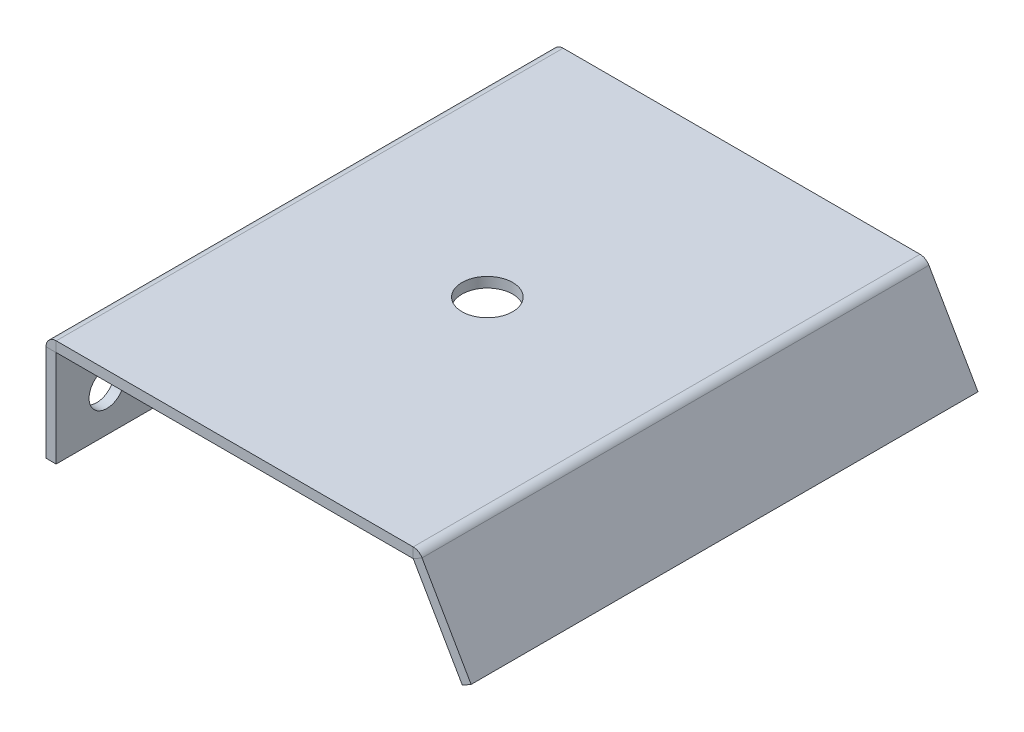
ISO-10303-21;
HEADER;
FILE_DESCRIPTION(('STEP AP214'),'2;1');
FILE_NAME('part.step','',(''),(''),'','','');
FILE_SCHEMA(('AUTOMOTIVE_DESIGN { 1 0 10303 214 1 1 1 1 }'));
ENDSEC;
DATA;
#1=APPLICATION_CONTEXT('core data for automotive mechanical design processes');
#2=APPLICATION_PROTOCOL_DEFINITION('international standard','automotive_design',2000,#1);
#3=PRODUCT_CONTEXT('',#1,'mechanical');
#4=PRODUCT('Part','Part','',(#3));
#5=PRODUCT_RELATED_PRODUCT_CATEGORY('part','',(#4));
#6=PRODUCT_DEFINITION_FORMATION('','',#4);
#7=PRODUCT_DEFINITION_CONTEXT('part definition',#1,'design');
#8=PRODUCT_DEFINITION('design','',#6,#7);
#9=PRODUCT_DEFINITION_SHAPE('','',#8);
#10=(LENGTH_UNIT() NAMED_UNIT(*) SI_UNIT(.MILLI.,.METRE.));
#11=(NAMED_UNIT(*) PLANE_ANGLE_UNIT() SI_UNIT($,.RADIAN.));
#12=(NAMED_UNIT(*) SI_UNIT($,.STERADIAN.) SOLID_ANGLE_UNIT());
#13=UNCERTAINTY_MEASURE_WITH_UNIT(LENGTH_MEASURE(1.E-05),#10,'distance_accuracy_value','');
#14=(GEOMETRIC_REPRESENTATION_CONTEXT(3) GLOBAL_UNCERTAINTY_ASSIGNED_CONTEXT((#13)) GLOBAL_UNIT_ASSIGNED_CONTEXT((#10,
#11,#12)) REPRESENTATION_CONTEXT('',''));
#15=CARTESIAN_POINT('',(0.,0.,0.));
#16=DIRECTION('',(0.,0.,1.));
#17=DIRECTION('',(1.,0.,0.));
#18=AXIS2_PLACEMENT_3D('',#15,#16,#17);
#19=CARTESIAN_POINT('',(0.,1.,0.));
#20=DIRECTION('',(0.,0.,-1.));
#21=DIRECTION('',(-1.,0.,0.));
#22=AXIS2_PLACEMENT_3D('',#19,#20,#21);
#23=PLANE('',#22);
#24=DIRECTION('',(1.,0.,0.));
#25=VECTOR('',#24,1.);
#26=CARTESIAN_POINT('',(0.,1.,0.));
#27=LINE('',#26,#25);
#28=CARTESIAN_POINT('',(10.4735950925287,0.999999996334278,0.));
#29=VERTEX_POINT('',#28);
#30=CARTESIAN_POINT('',(45.6842699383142,1.,0.));
#31=VERTEX_POINT('',#30);
#32=EDGE_CURVE('E271',#29,#31,#27,.T.);
#33=ORIENTED_EDGE('',*,*,#32,.F.);
#34=DIRECTION('',(0.,-1.,0.));
#35=VECTOR('',#34,1.);
#36=CARTESIAN_POINT('',(10.4735950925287,1.,0.));
#37=LINE('',#36,#35);
#38=CARTESIAN_POINT('',(10.4735950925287,0.,0.));
#39=VERTEX_POINT('',#38);
#40=EDGE_CURVE('E12',#29,#39,#37,.T.);
#41=ORIENTED_EDGE('',*,*,#40,.T.);
#42=DIRECTION('',(1.,0.,0.));
#43=VECTOR('',#42,1.);
#44=CARTESIAN_POINT('',(0.,0.,0.));
#45=LINE('',#44,#43);
#46=CARTESIAN_POINT('',(45.6842699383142,0.,0.));
#47=VERTEX_POINT('',#46);
#48=EDGE_CURVE('E216',#39,#47,#45,.T.);
#49=ORIENTED_EDGE('',*,*,#48,.T.);
#50=DIRECTION('',(0.,-1.,0.));
#51=VECTOR('',#50,1.);
#52=CARTESIAN_POINT('',(45.6842699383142,1.,0.));
#53=LINE('',#52,#51);
#54=EDGE_CURVE('E227',#31,#47,#53,.T.);
#55=ORIENTED_EDGE('',*,*,#54,.F.);
#56=EDGE_LOOP('',(#33,#41,#49,#55));
#57=FACE_BOUND('',#56,.T.);
#58=ADVANCED_FACE('F42',(#57),#23,.F.);
#59=CARTESIAN_POINT('',(0.,1.,-50.));
#60=DIRECTION('',(0.,0.,1.));
#61=DIRECTION('',(1.,0.,0.));
#62=AXIS2_PLACEMENT_3D('',#59,#60,#61);
#63=PLANE('',#62);
#64=DIRECTION('',(-1.,0.,0.));
#65=VECTOR('',#64,1.);
#66=CARTESIAN_POINT('',(0.,0.,-50.));
#67=LINE('',#66,#65);
#68=CARTESIAN_POINT('',(45.6842699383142,0.,-50.));
#69=VERTEX_POINT('',#68);
#70=CARTESIAN_POINT('',(10.4735950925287,-7.33144361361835E-09,-50.));
#71=VERTEX_POINT('',#70);
#72=EDGE_CURVE('E220',#69,#71,#67,.T.);
#73=ORIENTED_EDGE('',*,*,#72,.T.);
#74=DIRECTION('',(0.,1.,0.));
#75=VECTOR('',#74,1.);
#76=CARTESIAN_POINT('',(10.4735950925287,1.,-50.));
#77=LINE('',#76,#75);
#78=CARTESIAN_POINT('',(10.4735950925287,0.999999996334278,-50.));
#79=VERTEX_POINT('',#78);
#80=EDGE_CURVE('E265',#71,#79,#77,.T.);
#81=ORIENTED_EDGE('',*,*,#80,.T.);
#82=DIRECTION('',(-1.,0.,0.));
#83=VECTOR('',#82,1.);
#84=CARTESIAN_POINT('',(0.,1.,-50.));
#85=LINE('',#84,#83);
#86=CARTESIAN_POINT('',(45.6842699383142,1.000000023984,-50.));
#87=VERTEX_POINT('',#86);
#88=EDGE_CURVE('E45',#87,#79,#85,.T.);
#89=ORIENTED_EDGE('',*,*,#88,.F.);
#90=DIRECTION('',(0.,1.,0.));
#91=VECTOR('',#90,1.);
#92=CARTESIAN_POINT('',(45.6842699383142,1.,-50.));
#93=LINE('',#92,#91);
#94=EDGE_CURVE('E224',#69,#87,#93,.T.);
#95=ORIENTED_EDGE('',*,*,#94,.F.);
#96=EDGE_LOOP('',(#73,#81,#89,#95));
#97=FACE_BOUND('',#96,.T.);
#98=ADVANCED_FACE('F281',(#97),#63,.F.);
#99=CARTESIAN_POINT('',(0.,1.,-50.));
#100=DIRECTION('',(0.,-1.,0.));
#101=DIRECTION('',(0.,0.,-1.));
#102=AXIS2_PLACEMENT_3D('',#99,#100,#101);
#103=PLANE('',#102);
#104=CARTESIAN_POINT('',(28.,1.,-25.));
#105=DIRECTION('',(0.,1.,0.));
#106=DIRECTION('',(0.,0.,1.));
#107=AXIS2_PLACEMENT_3D('',#104,#105,#106);
#108=CIRCLE('',#107,2.5);
#109=CARTESIAN_POINT('',(28.,1.,-22.5));
#110=VERTEX_POINT('',#109);
#111=EDGE_CURVE('E221',#110,#110,#108,.T.);
#112=ORIENTED_EDGE('',*,*,#111,.F.);
#113=EDGE_LOOP('',(#112));
#114=FACE_BOUND('',#113,.T.);
#115=ORIENTED_EDGE('',*,*,#88,.T.);
#116=DIRECTION('',(0.,0.,1.));
#117=VECTOR('',#116,1.);
#118=CARTESIAN_POINT('',(10.4735950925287,1.,-50.));
#119=LINE('',#118,#117);
#120=EDGE_CURVE('E256',#79,#29,#119,.T.);
#121=ORIENTED_EDGE('',*,*,#120,.T.);
#122=ORIENTED_EDGE('',*,*,#32,.T.);
#123=DIRECTION('',(0.,0.,1.));
#124=VECTOR('',#123,1.);
#125=CARTESIAN_POINT('',(45.6842699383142,1.,-50.));
#126=LINE('',#125,#124);
#127=EDGE_CURVE('E212',#87,#31,#126,.T.);
#128=ORIENTED_EDGE('',*,*,#127,.F.);
#129=EDGE_LOOP('',(#115,#121,#122,#128));
#130=FACE_BOUND('',#129,.T.);
#131=ADVANCED_FACE('F277',(#114,#130),#103,.F.);
#132=CARTESIAN_POINT('',(23.4010905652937,40.6055988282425,-50.));
#133=DIRECTION('',(0.,0.,1.));
#134=DIRECTION('',(0.499999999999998,-0.86602540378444,0.));
#135=AXIS2_PLACEMENT_3D('',#132,#133,#134);
#136=PLANE('',#135);
#137=DIRECTION('',(-0.499999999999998,0.86602540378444,0.));
#138=VECTOR('',#137,1.);
#139=CARTESIAN_POINT('',(22.5350651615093,40.1055988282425,-50.));
#140=LINE('',#139,#138);
#141=CARTESIAN_POINT('',(50.5350651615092,-8.39182378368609,-50.));
#142=VERTEX_POINT('',#141);
#143=CARTESIAN_POINT('',(45.6929302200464,-0.0049999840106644,-50.));
#144=VERTEX_POINT('',#143);
#145=EDGE_CURVE('E234',#142,#144,#140,.T.);
#146=ORIENTED_EDGE('',*,*,#145,.T.);
#147=DIRECTION('',(0.86602540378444,0.499999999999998,0.));
#148=VECTOR('',#147,1.);
#149=CARTESIAN_POINT('',(46.5589555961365,0.494999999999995,-50.));
#150=LINE('',#149,#148);
#151=CARTESIAN_POINT('',(46.5589556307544,0.495000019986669,-50.));
#152=VERTEX_POINT('',#151);
#153=EDGE_CURVE('E249',#144,#152,#150,.T.);
#154=ORIENTED_EDGE('',*,*,#153,.T.);
#155=DIRECTION('',(-0.499999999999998,0.86602540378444,0.));
#156=VECTOR('',#155,1.);
#157=CARTESIAN_POINT('',(23.4010905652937,40.6055988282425,-50.));
#158=LINE('',#157,#156);
#159=CARTESIAN_POINT('',(51.4010905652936,-7.89182378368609,-50.));
#160=VERTEX_POINT('',#159);
#161=EDGE_CURVE('E238',#160,#152,#158,.T.);
#162=ORIENTED_EDGE('',*,*,#161,.F.);
#163=DIRECTION('',(-0.86602540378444,-0.499999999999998,0.));
#164=VECTOR('',#163,1.);
#165=CARTESIAN_POINT('',(51.4010905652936,-7.89182378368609,-50.));
#166=LINE('',#165,#164);
#167=EDGE_CURVE('E240',#160,#142,#166,.T.);
#168=ORIENTED_EDGE('',*,*,#167,.T.);
#169=EDGE_LOOP('',(#146,#154,#162,#168));
#170=FACE_BOUND('',#169,.T.);
#171=ADVANCED_FACE('F329',(#170),#136,.F.);
#172=CARTESIAN_POINT('',(23.4010905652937,40.6055988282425,0.));
#173=DIRECTION('',(0.,0.,-1.));
#174=DIRECTION('',(-0.499999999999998,0.86602540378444,0.));
#175=AXIS2_PLACEMENT_3D('',#172,#173,#174);
#176=PLANE('',#175);
#177=DIRECTION('',(0.499999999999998,-0.86602540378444,0.));
#178=VECTOR('',#177,1.);
#179=CARTESIAN_POINT('',(23.4010905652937,40.6055988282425,0.));
#180=LINE('',#179,#178);
#181=CARTESIAN_POINT('',(46.5589556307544,0.495000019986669,0.));
#182=VERTEX_POINT('',#181);
#183=CARTESIAN_POINT('',(51.4010905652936,-7.89182378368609,0.));
#184=VERTEX_POINT('',#183);
#185=EDGE_CURVE('E239',#182,#184,#180,.T.);
#186=ORIENTED_EDGE('',*,*,#185,.F.);
#187=DIRECTION('',(-0.86602540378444,-0.499999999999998,0.));
#188=VECTOR('',#187,1.);
#189=CARTESIAN_POINT('',(46.5589555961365,0.494999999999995,0.));
#190=LINE('',#189,#188);
#191=CARTESIAN_POINT('',(45.6929301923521,-0.005000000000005,0.));
#192=VERTEX_POINT('',#191);
#193=EDGE_CURVE('E253',#182,#192,#190,.T.);
#194=ORIENTED_EDGE('',*,*,#193,.T.);
#195=DIRECTION('',(0.499999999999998,-0.86602540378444,0.));
#196=VECTOR('',#195,1.);
#197=CARTESIAN_POINT('',(22.5350651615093,40.1055988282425,0.));
#198=LINE('',#197,#196);
#199=CARTESIAN_POINT('',(50.5350651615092,-8.39182378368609,0.));
#200=VERTEX_POINT('',#199);
#201=EDGE_CURVE('E235',#192,#200,#198,.T.);
#202=ORIENTED_EDGE('',*,*,#201,.T.);
#203=DIRECTION('',(-0.86602540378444,-0.499999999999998,0.));
#204=VECTOR('',#203,1.);
#205=CARTESIAN_POINT('',(51.4010905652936,-7.89182378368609,0.));
#206=LINE('',#205,#204);
#207=EDGE_CURVE('E243',#184,#200,#206,.T.);
#208=ORIENTED_EDGE('',*,*,#207,.F.);
#209=EDGE_LOOP('',(#186,#194,#202,#208));
#210=FACE_BOUND('',#209,.T.);
#211=ADVANCED_FACE('F321',(#210),#176,.F.);
#212=CARTESIAN_POINT('',(23.4010905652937,40.6055988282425,-50.));
#213=DIRECTION('',(-0.86602540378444,-0.499999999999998,0.));
#214=DIRECTION('',(0.,0.,-1.));
#215=AXIS2_PLACEMENT_3D('',#212,#213,#214);
#216=PLANE('',#215);
#217=ORIENTED_EDGE('',*,*,#161,.T.);
#218=DIRECTION('',(0.,0.,1.));
#219=VECTOR('',#218,1.);
#220=CARTESIAN_POINT('',(46.5589555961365,0.494999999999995,-50.));
#221=LINE('',#220,#219);
#222=EDGE_CURVE('E246',#152,#182,#221,.T.);
#223=ORIENTED_EDGE('',*,*,#222,.T.);
#224=ORIENTED_EDGE('',*,*,#185,.T.);
#225=DIRECTION('',(0.,0.,-1.));
#226=VECTOR('',#225,1.);
#227=CARTESIAN_POINT('',(51.4010905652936,-7.89182378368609,0.));
#228=LINE('',#227,#226);
#229=EDGE_CURVE('E236',#184,#160,#228,.T.);
#230=ORIENTED_EDGE('',*,*,#229,.T.);
#231=EDGE_LOOP('',(#217,#223,#224,#230));
#232=FACE_BOUND('',#231,.T.);
#233=ADVANCED_FACE('F325',(#232),#216,.F.);
#234=CARTESIAN_POINT('',(22.5350651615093,40.1055988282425,-50.));
#235=DIRECTION('',(-0.86602540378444,-0.499999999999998,0.));
#236=DIRECTION('',(0.,0.,-1.));
#237=AXIS2_PLACEMENT_3D('',#234,#235,#236);
#238=PLANE('',#237);
#239=DIRECTION('',(0.,0.,1.));
#240=VECTOR('',#239,1.);
#241=CARTESIAN_POINT('',(45.6929301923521,-0.005000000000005,-50.));
#242=LINE('',#241,#240);
#243=EDGE_CURVE('E65',#144,#192,#242,.T.);
#244=ORIENTED_EDGE('',*,*,#243,.F.);
#245=ORIENTED_EDGE('',*,*,#145,.F.);
#246=DIRECTION('',(0.,0.,-1.));
#247=VECTOR('',#246,1.);
#248=CARTESIAN_POINT('',(50.5350651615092,-8.39182378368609,0.));
#249=LINE('',#248,#247);
#250=EDGE_CURVE('E232',#200,#142,#249,.T.);
#251=ORIENTED_EDGE('',*,*,#250,.F.);
#252=ORIENTED_EDGE('',*,*,#201,.F.);
#253=EDGE_LOOP('',(#244,#245,#251,#252));
#254=FACE_BOUND('',#253,.T.);
#255=ADVANCED_FACE('F349',(#254),#238,.T.);
#256=CARTESIAN_POINT('',(51.4010905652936,-7.89182378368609,0.));
#257=DIRECTION('',(-0.499999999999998,0.86602540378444,0.));
#258=DIRECTION('',(0.,0.,1.));
#259=AXIS2_PLACEMENT_3D('',#256,#257,#258);
#260=PLANE('',#259);
#261=ORIENTED_EDGE('',*,*,#250,.T.);
#262=ORIENTED_EDGE('',*,*,#167,.F.);
#263=ORIENTED_EDGE('',*,*,#229,.F.);
#264=ORIENTED_EDGE('',*,*,#207,.T.);
#265=EDGE_LOOP('',(#261,#262,#263,#264));
#266=FACE_BOUND('',#265,.T.);
#267=ADVANCED_FACE('F343',(#266),#260,.F.);
#268=CARTESIAN_POINT('',(28.,1.,-25.));
#269=DIRECTION('',(0.,-1.,0.));
#270=DIRECTION('',(0.,0.,-1.));
#271=AXIS2_PLACEMENT_3D('',#268,#269,#270);
#272=CYLINDRICAL_SURFACE('',#271,2.5);
#273=ORIENTED_EDGE('',*,*,#111,.T.);
#274=EDGE_LOOP('',(#273));
#275=FACE_BOUND('',#274,.T.);
#276=CARTESIAN_POINT('',(28.,0.,-25.));
#277=DIRECTION('',(0.,1.,0.));
#278=DIRECTION('',(0.,0.,1.));
#279=AXIS2_PLACEMENT_3D('',#276,#277,#278);
#280=CIRCLE('',#279,2.5);
#281=CARTESIAN_POINT('',(28.,0.,-22.5));
#282=VERTEX_POINT('',#281);
#283=EDGE_CURVE('E217',#282,#282,#280,.T.);
#284=ORIENTED_EDGE('',*,*,#283,.F.);
#285=EDGE_LOOP('',(#284));
#286=FACE_BOUND('',#285,.T.);
#287=ADVANCED_FACE('F339',(#275,#286),#272,.F.);
#288=CARTESIAN_POINT('',(0.,0.,-50.));
#289=DIRECTION('',(0.,-1.,0.));
#290=DIRECTION('',(0.,0.,-1.));
#291=AXIS2_PLACEMENT_3D('',#288,#289,#290);
#292=PLANE('',#291);
#293=DIRECTION('',(0.,0.,1.));
#294=VECTOR('',#293,1.);
#295=CARTESIAN_POINT('',(10.4735950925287,0.,-50.));
#296=LINE('',#295,#294);
#297=EDGE_CURVE('E50',#71,#39,#296,.T.);
#298=ORIENTED_EDGE('',*,*,#297,.F.);
#299=ORIENTED_EDGE('',*,*,#72,.F.);
#300=DIRECTION('',(0.,0.,1.));
#301=VECTOR('',#300,1.);
#302=CARTESIAN_POINT('',(45.6842699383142,0.,-50.));
#303=LINE('',#302,#301);
#304=EDGE_CURVE('E213',#69,#47,#303,.T.);
#305=ORIENTED_EDGE('',*,*,#304,.T.);
#306=ORIENTED_EDGE('',*,*,#48,.F.);
#307=EDGE_LOOP('',(#298,#299,#305,#306));
#308=FACE_BOUND('',#307,.T.);
#309=ORIENTED_EDGE('',*,*,#283,.T.);
#310=EDGE_LOOP('',(#309));
#311=FACE_BOUND('',#310,.T.);
#312=ADVANCED_FACE('F336',(#308,#311),#292,.T.);
#313=CARTESIAN_POINT('',(45.6842699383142,-0.0100000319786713,-50.));
#314=DIRECTION('',(0.,0.,-1.));
#315=DIRECTION('',(-1.,0.,0.));
#316=AXIS2_PLACEMENT_3D('',#313,#314,#315);
#317=PLANE('',#316);
#318=ORIENTED_EDGE('',*,*,#153,.F.);
#319=CARTESIAN_POINT('',(45.6842699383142,-0.01,-50.));
#320=DIRECTION('',(0.,0.,-1.));
#321=DIRECTION('',(-1.,0.,0.));
#322=AXIS2_PLACEMENT_3D('',#319,#320,#321);
#323=CIRCLE('',#322,0.0100000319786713);
#324=EDGE_CURVE('E201',#144,#69,#323,.F.);
#325=ORIENTED_EDGE('',*,*,#324,.T.);
#326=ORIENTED_EDGE('',*,*,#94,.T.);
#327=CARTESIAN_POINT('',(45.6842699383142,-0.0100000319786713,-50.));
#328=DIRECTION('',(0.,0.,1.));
#329=DIRECTION('',(1.,0.,0.));
#330=AXIS2_PLACEMENT_3D('',#327,#328,#329);
#331=CIRCLE('',#330,1.01000005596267);
#332=EDGE_CURVE('E204',#152,#87,#331,.T.);
#333=ORIENTED_EDGE('',*,*,#332,.F.);
#334=EDGE_LOOP('',(#318,#325,#326,#333));
#335=FACE_BOUND('',#334,.T.);
#336=ADVANCED_FACE('F332',(#335),#317,.T.);
#337=CARTESIAN_POINT('',(45.6842699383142,-0.0100000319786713,0.));
#338=DIRECTION('',(0.,0.,1.));
#339=DIRECTION('',(1.,0.,0.));
#340=AXIS2_PLACEMENT_3D('',#337,#338,#339);
#341=PLANE('',#340);
#342=ORIENTED_EDGE('',*,*,#54,.T.);
#343=CARTESIAN_POINT('',(45.6842699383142,-0.01,0.));
#344=DIRECTION('',(0.,0.,-1.));
#345=DIRECTION('',(-1.,0.,0.));
#346=AXIS2_PLACEMENT_3D('',#343,#344,#345);
#347=CIRCLE('',#346,0.0100000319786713);
#348=EDGE_CURVE('E202',#47,#192,#347,.T.);
#349=ORIENTED_EDGE('',*,*,#348,.T.);
#350=ORIENTED_EDGE('',*,*,#193,.F.);
#351=CARTESIAN_POINT('',(45.6842699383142,-0.0100000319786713,0.));
#352=DIRECTION('',(0.,0.,-1.));
#353=DIRECTION('',(-1.,0.,0.));
#354=AXIS2_PLACEMENT_3D('',#351,#352,#353);
#355=CIRCLE('',#354,1.01000005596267);
#356=EDGE_CURVE('E209',#31,#182,#355,.T.);
#357=ORIENTED_EDGE('',*,*,#356,.F.);
#358=EDGE_LOOP('',(#342,#349,#350,#357));
#359=FACE_BOUND('',#358,.T.);
#360=ADVANCED_FACE('F317',(#359),#341,.T.);
#361=CARTESIAN_POINT('',(45.6842699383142,-0.01,25.0139854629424));
#362=DIRECTION('',(0.,0.,-1.));
#363=DIRECTION('',(-1.,0.,0.));
#364=AXIS2_PLACEMENT_3D('',#361,#362,#363);
#365=CYLINDRICAL_SURFACE('',#364,1.01000003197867);
#366=ORIENTED_EDGE('',*,*,#356,.T.);
#367=ORIENTED_EDGE('',*,*,#222,.F.);
#368=ORIENTED_EDGE('',*,*,#332,.T.);
#369=ORIENTED_EDGE('',*,*,#127,.T.);
#370=EDGE_LOOP('',(#366,#367,#368,#369));
#371=FACE_BOUND('',#370,.T.);
#372=ADVANCED_FACE('F315',(#371),#365,.T.);
#373=CARTESIAN_POINT('',(45.6842699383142,-0.01,25.0139854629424));
#374=DIRECTION('',(0.,0.,-1.));
#375=DIRECTION('',(-1.,0.,0.));
#376=AXIS2_PLACEMENT_3D('',#373,#374,#375);
#377=CYLINDRICAL_SURFACE('',#376,0.0100000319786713);
#378=ORIENTED_EDGE('',*,*,#348,.F.);
#379=ORIENTED_EDGE('',*,*,#304,.F.);
#380=ORIENTED_EDGE('',*,*,#324,.F.);
#381=ORIENTED_EDGE('',*,*,#243,.T.);
#382=EDGE_LOOP('',(#378,#379,#380,#381));
#383=FACE_BOUND('',#382,.T.);
#384=ADVANCED_FACE('F334',(#383),#377,.F.);
#385=CARTESIAN_POINT('',(10.4735950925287,-0.00999999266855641,-50.));
#386=DIRECTION('',(0.,0.,-1.));
#387=DIRECTION('',(-1.,0.,0.));
#388=AXIS2_PLACEMENT_3D('',#385,#386,#387);
#389=PLANE('',#388);
#390=ORIENTED_EDGE('',*,*,#80,.F.);
#391=CARTESIAN_POINT('',(10.4735950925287,-0.01,-50.));
#392=DIRECTION('',(0.,0.,1.));
#393=DIRECTION('',(1.,0.,0.));
#394=AXIS2_PLACEMENT_3D('',#391,#392,#393);
#395=CIRCLE('',#394,0.00999999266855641);
#396=CARTESIAN_POINT('',(10.4635950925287,-0.00999999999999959,-50.));
#397=VERTEX_POINT('',#396);
#398=EDGE_CURVE('E163',#71,#397,#395,.T.);
#399=ORIENTED_EDGE('',*,*,#398,.T.);
#400=DIRECTION('',(-1.,0.,0.));
#401=VECTOR('',#400,1.);
#402=CARTESIAN_POINT('',(9.46359509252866,-0.0100000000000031,-50.));
#403=LINE('',#402,#401);
#404=CARTESIAN_POINT('',(9.46359509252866,-0.0100000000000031,-50.));
#405=VERTEX_POINT('',#404);
#406=EDGE_CURVE('E185',#397,#405,#403,.T.);
#407=ORIENTED_EDGE('',*,*,#406,.T.);
#408=CARTESIAN_POINT('',(10.4735950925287,-0.00999999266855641,-50.));
#409=DIRECTION('',(0.,0.,1.));
#410=DIRECTION('',(1.,0.,0.));
#411=AXIS2_PLACEMENT_3D('',#408,#409,#410);
#412=CIRCLE('',#411,1.00999998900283);
#413=EDGE_CURVE('E193',#79,#405,#412,.T.);
#414=ORIENTED_EDGE('',*,*,#413,.F.);
#415=EDGE_LOOP('',(#390,#399,#407,#414));
#416=FACE_BOUND('',#415,.T.);
#417=ADVANCED_FACE('F283',(#416),#389,.T.);
#418=CARTESIAN_POINT('',(10.4735950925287,-0.00999999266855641,0.));
#419=DIRECTION('',(0.,0.,1.));
#420=DIRECTION('',(1.,0.,0.));
#421=AXIS2_PLACEMENT_3D('',#418,#419,#420);
#422=PLANE('',#421);
#423=DIRECTION('',(1.,0.,0.));
#424=VECTOR('',#423,1.);
#425=CARTESIAN_POINT('',(9.46359509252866,-0.0100000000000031,0.));
#426=LINE('',#425,#424);
#427=CARTESIAN_POINT('',(9.46359509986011,-0.0100000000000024,0.));
#428=VERTEX_POINT('',#427);
#429=CARTESIAN_POINT('',(10.4635950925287,-0.00999999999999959,0.));
#430=VERTEX_POINT('',#429);
#431=EDGE_CURVE('E142',#428,#430,#426,.T.);
#432=ORIENTED_EDGE('',*,*,#431,.T.);
#433=CARTESIAN_POINT('',(10.4735950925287,-0.01,0.));
#434=DIRECTION('',(0.,0.,1.));
#435=DIRECTION('',(1.,0.,0.));
#436=AXIS2_PLACEMENT_3D('',#433,#434,#435);
#437=CIRCLE('',#436,0.00999999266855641);
#438=EDGE_CURVE('E191',#430,#39,#437,.F.);
#439=ORIENTED_EDGE('',*,*,#438,.T.);
#440=ORIENTED_EDGE('',*,*,#40,.F.);
#441=CARTESIAN_POINT('',(10.4735950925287,-0.00999999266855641,0.));
#442=DIRECTION('',(0.,0.,-1.));
#443=DIRECTION('',(-1.,0.,0.));
#444=AXIS2_PLACEMENT_3D('',#441,#442,#443);
#445=CIRCLE('',#444,1.00999998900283);
#446=EDGE_CURVE('E198',#428,#29,#445,.T.);
#447=ORIENTED_EDGE('',*,*,#446,.F.);
#448=EDGE_LOOP('',(#432,#439,#440,#447));
#449=FACE_BOUND('',#448,.T.);
#450=ADVANCED_FACE('F291',(#449),#422,.T.);
#451=CARTESIAN_POINT('',(10.4735950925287,-0.01,-75.0189680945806));
#452=DIRECTION('',(0.,0.,1.));
#453=DIRECTION('',(1.,0.,0.));
#454=AXIS2_PLACEMENT_3D('',#451,#452,#453);
#455=CYLINDRICAL_SURFACE('',#454,1.00999999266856);
#456=ORIENTED_EDGE('',*,*,#446,.T.);
#457=ORIENTED_EDGE('',*,*,#120,.F.);
#458=ORIENTED_EDGE('',*,*,#413,.T.);
#459=DIRECTION('',(0.,0.,1.));
#460=VECTOR('',#459,1.);
#461=CARTESIAN_POINT('',(9.46359509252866,-0.0100000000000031,-50.));
#462=LINE('',#461,#460);
#463=EDGE_CURVE('E189',#405,#428,#462,.T.);
#464=ORIENTED_EDGE('',*,*,#463,.T.);
#465=EDGE_LOOP('',(#456,#457,#458,#464));
#466=FACE_BOUND('',#465,.T.);
#467=ADVANCED_FACE('F294',(#466),#455,.T.);
#468=CARTESIAN_POINT('',(10.4735950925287,-0.01,-75.0189680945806));
#469=DIRECTION('',(0.,0.,1.));
#470=DIRECTION('',(1.,0.,0.));
#471=AXIS2_PLACEMENT_3D('',#468,#469,#470);
#472=CYLINDRICAL_SURFACE('',#471,0.00999999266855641);
#473=ORIENTED_EDGE('',*,*,#438,.F.);
#474=DIRECTION('',(0.,0.,1.));
#475=VECTOR('',#474,1.);
#476=CARTESIAN_POINT('',(10.4635950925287,-0.00999999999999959,-50.));
#477=LINE('',#476,#475);
#478=EDGE_CURVE('E161',#397,#430,#477,.T.);
#479=ORIENTED_EDGE('',*,*,#478,.F.);
#480=ORIENTED_EDGE('',*,*,#398,.F.);
#481=ORIENTED_EDGE('',*,*,#297,.T.);
#482=EDGE_LOOP('',(#473,#479,#480,#481));
#483=FACE_BOUND('',#482,.T.);
#484=ADVANCED_FACE('F285',(#483),#472,.F.);
#485=CARTESIAN_POINT('',(9.46359509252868,-5.53640490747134,-45.));
#486=DIRECTION('',(1.,0.,0.));
#487=DIRECTION('',(0.,0.,-1.));
#488=AXIS2_PLACEMENT_3D('',#485,#486,#487);
#489=CYLINDRICAL_SURFACE('',#488,1.75);
#490=CARTESIAN_POINT('',(9.46359509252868,-5.53640490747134,-45.));
#491=DIRECTION('',(-1.,0.,0.));
#492=DIRECTION('',(0.,0.,1.));
#493=AXIS2_PLACEMENT_3D('',#490,#491,#492);
#494=CIRCLE('',#493,1.75);
#495=CARTESIAN_POINT('',(9.46359509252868,-5.53640490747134,-43.25));
#496=VERTEX_POINT('',#495);
#497=EDGE_CURVE('E182',#496,#496,#494,.T.);
#498=ORIENTED_EDGE('',*,*,#497,.T.);
#499=EDGE_LOOP('',(#498));
#500=FACE_BOUND('',#499,.T.);
#501=CARTESIAN_POINT('',(10.4635950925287,-5.53640490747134,-45.));
#502=DIRECTION('',(-1.,0.,0.));
#503=DIRECTION('',(0.,0.,1.));
#504=AXIS2_PLACEMENT_3D('',#501,#502,#503);
#505=CIRCLE('',#504,1.75);
#506=CARTESIAN_POINT('',(10.4635950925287,-5.53640490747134,-43.25));
#507=VERTEX_POINT('',#506);
#508=EDGE_CURVE('E166',#507,#507,#505,.T.);
#509=ORIENTED_EDGE('',*,*,#508,.F.);
#510=EDGE_LOOP('',(#509));
#511=FACE_BOUND('',#510,.T.);
#512=ADVANCED_FACE('F518',(#500,#511),#489,.F.);
#513=CARTESIAN_POINT('',(9.46359509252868,-5.53640490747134,-5.));
#514=DIRECTION('',(1.,0.,0.));
#515=DIRECTION('',(0.,0.,-1.));
#516=AXIS2_PLACEMENT_3D('',#513,#514,#515);
#517=CYLINDRICAL_SURFACE('',#516,1.75);
#518=CARTESIAN_POINT('',(9.46359509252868,-5.53640490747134,-5.));
#519=DIRECTION('',(-1.,0.,0.));
#520=DIRECTION('',(0.,0.,1.));
#521=AXIS2_PLACEMENT_3D('',#518,#519,#520);
#522=CIRCLE('',#521,1.75);
#523=CARTESIAN_POINT('',(9.46359509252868,-5.53640490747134,-3.25));
#524=VERTEX_POINT('',#523);
#525=EDGE_CURVE('E179',#524,#524,#522,.T.);
#526=ORIENTED_EDGE('',*,*,#525,.T.);
#527=EDGE_LOOP('',(#526));
#528=FACE_BOUND('',#527,.T.);
#529=CARTESIAN_POINT('',(10.4635950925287,-5.53640490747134,-5.));
#530=DIRECTION('',(-1.,0.,0.));
#531=DIRECTION('',(0.,0.,1.));
#532=AXIS2_PLACEMENT_3D('',#529,#530,#531);
#533=CIRCLE('',#532,1.75);
#534=CARTESIAN_POINT('',(10.4635950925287,-5.53640490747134,-3.25));
#535=VERTEX_POINT('',#534);
#536=EDGE_CURVE('E171',#535,#535,#533,.T.);
#537=ORIENTED_EDGE('',*,*,#536,.F.);
#538=EDGE_LOOP('',(#537));
#539=FACE_BOUND('',#538,.T.);
#540=ADVANCED_FACE('F554',(#528,#539),#517,.F.);
#541=CARTESIAN_POINT('',(9.4635950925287,-9.53640490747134,0.));
#542=DIRECTION('',(0.,1.,0.));
#543=DIRECTION('',(0.,0.,-1.));
#544=AXIS2_PLACEMENT_3D('',#541,#542,#543);
#545=PLANE('',#544);
#546=DIRECTION('',(0.,0.,1.));
#547=VECTOR('',#546,1.);
#548=CARTESIAN_POINT('',(10.4635950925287,-9.53640490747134,0.));
#549=LINE('',#548,#547);
#550=CARTESIAN_POINT('',(10.4635950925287,-9.53640490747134,-50.));
#551=VERTEX_POINT('',#550);
#552=CARTESIAN_POINT('',(10.4635950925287,-9.53640490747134,0.));
#553=VERTEX_POINT('',#552);
#554=EDGE_CURVE('E159',#551,#553,#549,.T.);
#555=ORIENTED_EDGE('',*,*,#554,.T.);
#556=DIRECTION('',(1.,0.,0.));
#557=VECTOR('',#556,1.);
#558=CARTESIAN_POINT('',(9.4635950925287,-9.53640490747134,0.));
#559=LINE('',#558,#557);
#560=CARTESIAN_POINT('',(9.4635950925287,-9.53640490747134,0.));
#561=VERTEX_POINT('',#560);
#562=EDGE_CURVE('E139',#561,#553,#559,.T.);
#563=ORIENTED_EDGE('',*,*,#562,.F.);
#564=DIRECTION('',(0.,0.,1.));
#565=VECTOR('',#564,1.);
#566=CARTESIAN_POINT('',(9.4635950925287,-9.53640490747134,0.));
#567=LINE('',#566,#565);
#568=CARTESIAN_POINT('',(9.4635950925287,-9.53640490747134,-50.));
#569=VERTEX_POINT('',#568);
#570=EDGE_CURVE('E146',#569,#561,#567,.T.);
#571=ORIENTED_EDGE('',*,*,#570,.F.);
#572=DIRECTION('',(1.,0.,0.));
#573=VECTOR('',#572,1.);
#574=CARTESIAN_POINT('',(9.4635950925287,-9.53640490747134,-50.));
#575=LINE('',#574,#573);
#576=EDGE_CURVE('E176',#569,#551,#575,.T.);
#577=ORIENTED_EDGE('',*,*,#576,.T.);
#578=EDGE_LOOP('',(#555,#563,#571,#577));
#579=FACE_BOUND('',#578,.T.);
#580=ADVANCED_FACE('F157',(#579),#545,.F.);
#581=CARTESIAN_POINT('',(9.4635950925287,-9.53640490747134,-50.));
#582=DIRECTION('',(1.,0.,0.));
#583=DIRECTION('',(0.,0.,-1.));
#584=AXIS2_PLACEMENT_3D('',#581,#582,#583);
#585=PLANE('',#584);
#586=ORIENTED_EDGE('',*,*,#463,.F.);
#587=DIRECTION('',(0.,-1.,0.));
#588=VECTOR('',#587,1.);
#589=CARTESIAN_POINT('',(9.4635950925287,-9.53640490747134,-50.));
#590=LINE('',#589,#588);
#591=EDGE_CURVE('E152',#405,#569,#590,.T.);
#592=ORIENTED_EDGE('',*,*,#591,.T.);
#593=ORIENTED_EDGE('',*,*,#570,.T.);
#594=DIRECTION('',(0.,1.,0.));
#595=VECTOR('',#594,1.);
#596=CARTESIAN_POINT('',(9.4635950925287,-9.53640490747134,0.));
#597=LINE('',#596,#595);
#598=EDGE_CURVE('E135',#561,#428,#597,.T.);
#599=ORIENTED_EDGE('',*,*,#598,.T.);
#600=EDGE_LOOP('',(#586,#592,#593,#599));
#601=FACE_BOUND('',#600,.T.);
#602=ORIENTED_EDGE('',*,*,#525,.F.);
#603=EDGE_LOOP('',(#602));
#604=FACE_BOUND('',#603,.T.);
#605=ORIENTED_EDGE('',*,*,#497,.F.);
#606=EDGE_LOOP('',(#605));
#607=FACE_BOUND('',#606,.T.);
#608=ADVANCED_FACE('F149',(#601,#604,#607),#585,.F.);
#609=CARTESIAN_POINT('',(9.4635950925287,-9.53640490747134,-50.));
#610=DIRECTION('',(0.,0.,1.));
#611=DIRECTION('',(0.,1.,0.));
#612=AXIS2_PLACEMENT_3D('',#609,#610,#611);
#613=PLANE('',#612);
#614=ORIENTED_EDGE('',*,*,#406,.F.);
#615=DIRECTION('',(0.,-1.,0.));
#616=VECTOR('',#615,1.);
#617=CARTESIAN_POINT('',(10.4635950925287,-9.53640490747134,-50.));
#618=LINE('',#617,#616);
#619=EDGE_CURVE('E145',#397,#551,#618,.T.);
#620=ORIENTED_EDGE('',*,*,#619,.T.);
#621=ORIENTED_EDGE('',*,*,#576,.F.);
#622=ORIENTED_EDGE('',*,*,#591,.F.);
#623=EDGE_LOOP('',(#614,#620,#621,#622));
#624=FACE_BOUND('',#623,.T.);
#625=ADVANCED_FACE('F296',(#624),#613,.F.);
#626=CARTESIAN_POINT('',(10.4635950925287,-9.53640490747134,-50.));
#627=DIRECTION('',(1.,0.,0.));
#628=DIRECTION('',(0.,0.,-1.));
#629=AXIS2_PLACEMENT_3D('',#626,#627,#628);
#630=PLANE('',#629);
#631=ORIENTED_EDGE('',*,*,#536,.T.);
#632=EDGE_LOOP('',(#631));
#633=FACE_BOUND('',#632,.T.);
#634=ORIENTED_EDGE('',*,*,#508,.T.);
#635=EDGE_LOOP('',(#634));
#636=FACE_BOUND('',#635,.T.);
#637=ORIENTED_EDGE('',*,*,#619,.F.);
#638=ORIENTED_EDGE('',*,*,#478,.T.);
#639=DIRECTION('',(0.,1.,0.));
#640=VECTOR('',#639,1.);
#641=CARTESIAN_POINT('',(10.4635950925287,-9.53640490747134,0.));
#642=LINE('',#641,#640);
#643=EDGE_CURVE('E160',#553,#430,#642,.T.);
#644=ORIENTED_EDGE('',*,*,#643,.F.);
#645=ORIENTED_EDGE('',*,*,#554,.F.);
#646=EDGE_LOOP('',(#637,#638,#644,#645));
#647=FACE_BOUND('',#646,.T.);
#648=ADVANCED_FACE('F287',(#633,#636,#647),#630,.T.);
#649=CARTESIAN_POINT('',(9.4635950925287,-9.53640490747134,0.));
#650=DIRECTION('',(0.,0.,-1.));
#651=DIRECTION('',(0.,-1.,0.));
#652=AXIS2_PLACEMENT_3D('',#649,#650,#651);
#653=PLANE('',#652);
#654=ORIENTED_EDGE('',*,*,#431,.F.);
#655=ORIENTED_EDGE('',*,*,#598,.F.);
#656=ORIENTED_EDGE('',*,*,#562,.T.);
#657=ORIENTED_EDGE('',*,*,#643,.T.);
#658=EDGE_LOOP('',(#654,#655,#656,#657));
#659=FACE_BOUND('',#658,.T.);
#660=ADVANCED_FACE('F137',(#659),#653,.F.);
#661=CLOSED_SHELL('',(#58,#98,#131,#171,#211,#233,#255,#267,#287,#312,#336,#360,#372,#384,#417,
#450,#467,#484,#512,#540,#580,#608,#625,#648,#660));
#662=MANIFOLD_SOLID_BREP('B2',#661);
#663=ADVANCED_BREP_SHAPE_REPRESENTATION('',(#18,#662),#14);
#664=SHAPE_DEFINITION_REPRESENTATION(#9,#663);
ENDSEC;
END-ISO-10303-21;
